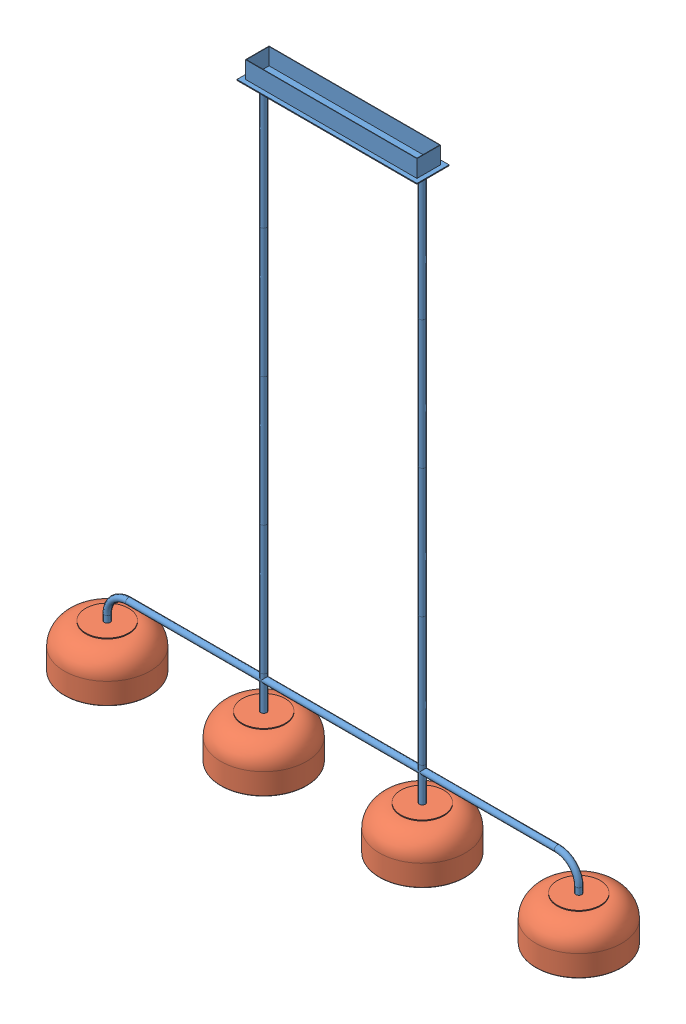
SolidWorks assembly Ensamblaje1.SLDASM, configuration Predeterminado (file format 11000). Lengths in mm.
Overall size (1300.41 1424 200.41).
5 component instances, 2 part files, 8 mates.
Components (placement in the parent):
- cuerpo-1: cuerpo.SLDPRT [Predeterminado] at origin size (1114 1322 75)
- tulipa_cristal-1: tulipa_cristal.SLDPRT [Predeterminado] at (-550 -97 0) x (0.999998 0 -0.002077) z (0.002077 0 0.999998) size (200 117 200)
- tulipa_cristal-2: tulipa_cristal.SLDPRT [Predeterminado] at (550 -97 0) x (0.999998 0 -0.002077) z (0.002077 0 0.999998) size (200 117 200)
- tulipa_cristal-3: tulipa_cristal.SLDPRT [Predeterminado] at (-185 -97 0) x (0.999998 0 -0.002077) z (0.002077 0 0.999998) size (200 117 200)
- tulipa_cristal-4: tulipa_cristal.SLDPRT [Predeterminado] at (185 -97 0) x (0.999998 0 -0.002077) z (0.002077 0 0.999998) size (200 117 200)
Mates (geometry in assembly coordinates):
- Concéntrica1: concentric: cylinder of assembly; cylinder of assembly; cylinder of cuerpo-1 through (-550 -65 0) axis (0 1 0) radius 7; cylinder of tulipa_cristal-1 through (-550 -50 0) axis (0 -1 0) radius 6
- Coincidente1: coincident: plane of assembly; plane of assembly; plane of cuerpo-1 through (-550 -65 0) normal (0 -1 0); plane of tulipa_cristal-1 through (-550 -65 0) normal (0 1 0)
- Concéntrica2: concentric: cylinder of cuerpo-1 through (550 -50 0) axis (0 -1 0) radius 7; cylinder of tulipa_cristal-2 through (550 -50 0) axis (0 -1 0) radius 6
- Coincidente2: coincident: plane of cuerpo-1 through (550 -65 0) normal (0 -1 0); plane of tulipa_cristal-2 through (550 -65 0) normal (0 1 0)
- Concéntrica3: concentric: cylinder of assembly; cylinder of assembly; cylinder of cuerpo-1 through (-185 0 0) axis (0 -1 0) radius 7; cylinder of tulipa_cristal-3 through (-185 -50 0) axis (0 -1 0) radius 6
- Coincidente3: coincident: plane of assembly; plane of assembly; plane of cuerpo-1 through (-185 -65 0) normal (0 -1 0); plane of tulipa_cristal-3 through (-185 -65 0) normal (0 1 0)
- Concéntrica4: concentric: cylinder of assembly; cylinder of assembly; cylinder of cuerpo-1 through (185 0 0) axis (0 -1 0) radius 7; cylinder of tulipa_cristal-4 through (185 -50 0) axis (0 -1 0) radius 6
- Coincidente4: coincident: plane of assembly; plane of assembly; plane of cuerpo-1 through (185 -65 0) normal (0 -1 0); plane of tulipa_cristal-4 through (185 -65 0) normal (0 1 0)
